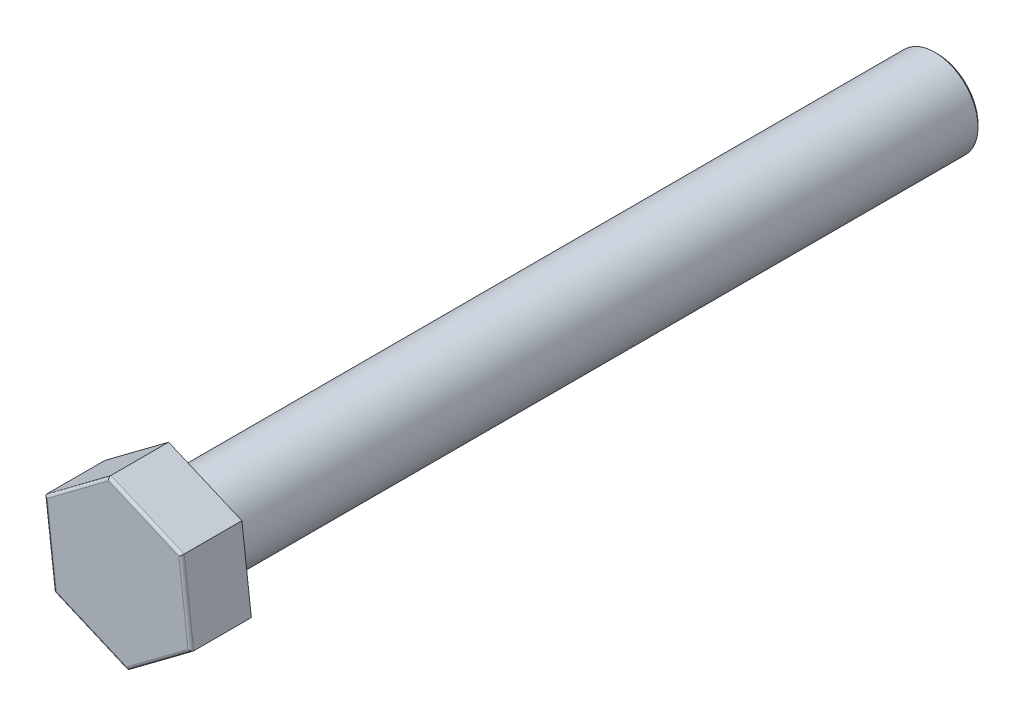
from build123d import *

# Parameters (mm, degrees)
SKETCH1_R           = 3.96875
BOSS_EXTRUDE1_DEPTH = 69.85
BOSS_EXTRUDE2_DEPTH = 5.55625
FILLET1_R           = 0.254
CHAMFER1_SIZE       = 0.254


with BuildPart() as part:
    # Sketch1 → Boss-Extrude1 (new body)
    with BuildSketch(Plane.XY):
        Circle(SKETCH1_R)
    extrude(amount=BOSS_EXTRUDE1_DEPTH)

    # Sketch2 → Boss-Extrude2 (add)
    with BuildSketch(Plane.XY.offset(69.85)):
        Polygon((6.740166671, -2.886777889), (5.870106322, 4.393766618), (-0.870060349, 7.280544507), (-6.740166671, 2.886777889), (-5.870106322, -4.393766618), (0.870060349, -7.280544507), align=None)
    extrude(amount=BOSS_EXTRUDE2_DEPTH)

    # Fillet1
    fillet1_edges = [part.edges().sort_by_distance(p)[0] for p in [
        (3.80511351, -5.083661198, 75.40625),
        (6.305136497, 0.753494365, 75.40625),
        (2.500022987, 5.837155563, 75.40625),
        (-3.80511351, 5.083661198, 75.40625),
        (-6.305136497, -0.753494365, 75.40625),
        (-2.500022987, -5.837155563, 75.40625),
    ]]
    fillet(fillet1_edges, radius=FILLET1_R)

    # Chamfer1
    chamfer1_edges = [part.edges().sort_by_distance(p)[0] for p in [
        (-3.96875, 0, 0),
    ]]
    chamfer(chamfer1_edges, length=CHAMFER1_SIZE)


solid = part.part
